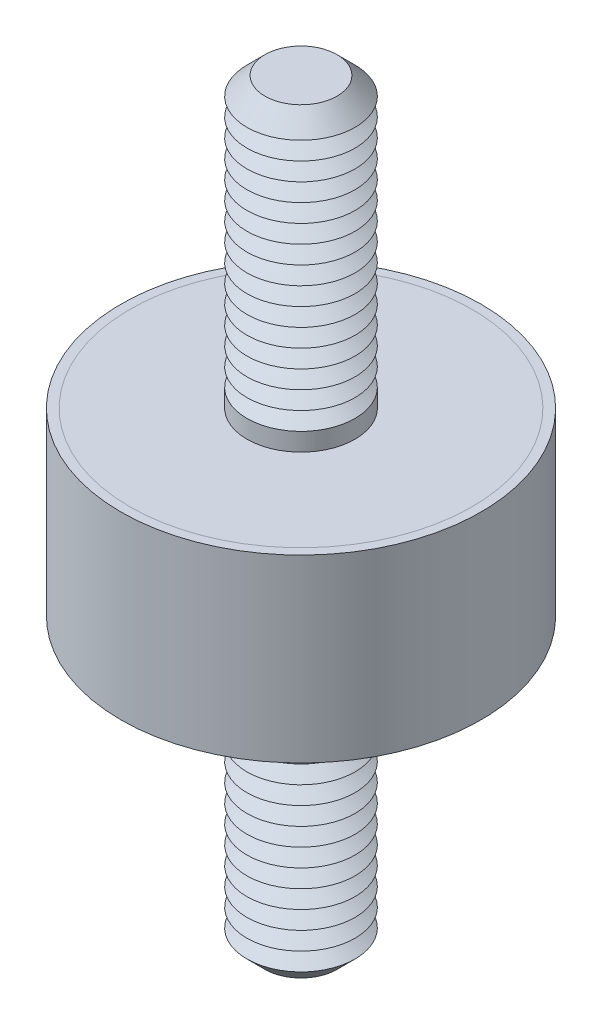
ISO-10303-21;
HEADER;
FILE_DESCRIPTION(('STEP AP214'),'2;1');
FILE_NAME('part.step','',(''),(''),'','','');
FILE_SCHEMA(('AUTOMOTIVE_DESIGN { 1 0 10303 214 1 1 1 1 }'));
ENDSEC;
DATA;
#1=APPLICATION_CONTEXT('core data for automotive mechanical design processes');
#2=APPLICATION_PROTOCOL_DEFINITION('international standard','automotive_design',2000,#1);
#3=PRODUCT_CONTEXT('',#1,'mechanical');
#4=PRODUCT('Part','Part','',(#3));
#5=PRODUCT_RELATED_PRODUCT_CATEGORY('part','',(#4));
#6=PRODUCT_DEFINITION_FORMATION('','',#4);
#7=PRODUCT_DEFINITION_CONTEXT('part definition',#1,'design');
#8=PRODUCT_DEFINITION('design','',#6,#7);
#9=PRODUCT_DEFINITION_SHAPE('','',#8);
#10=(LENGTH_UNIT() NAMED_UNIT(*) SI_UNIT(.MILLI.,.METRE.));
#11=(NAMED_UNIT(*) PLANE_ANGLE_UNIT() SI_UNIT($,.RADIAN.));
#12=(NAMED_UNIT(*) SI_UNIT($,.STERADIAN.) SOLID_ANGLE_UNIT());
#13=UNCERTAINTY_MEASURE_WITH_UNIT(LENGTH_MEASURE(1.E-05),#10,'distance_accuracy_value','');
#14=(GEOMETRIC_REPRESENTATION_CONTEXT(3) GLOBAL_UNCERTAINTY_ASSIGNED_CONTEXT((#13)) GLOBAL_UNIT_ASSIGNED_CONTEXT((#10,
#11,#12)) REPRESENTATION_CONTEXT('',''));
#15=CARTESIAN_POINT('',(0.,0.,0.));
#16=DIRECTION('',(0.,0.,1.));
#17=DIRECTION('',(1.,0.,0.));
#18=AXIS2_PLACEMENT_3D('',#15,#16,#17);
#19=CARTESIAN_POINT('',(0.,-21.,0.));
#20=DIRECTION('',(0.,1.,0.));
#21=DIRECTION('',(0.,0.,1.));
#22=AXIS2_PLACEMENT_3D('',#19,#20,#21);
#23=CYLINDRICAL_SURFACE('',#22,3.);
#24=CARTESIAN_POINT('',(0.,-5.,0.));
#25=DIRECTION('',(0.,-1.,0.));
#26=DIRECTION('',(0.,0.,-1.));
#27=AXIS2_PLACEMENT_3D('',#24,#25,#26);
#28=CIRCLE('',#27,3.);
#29=CARTESIAN_POINT('',(0.,-5.,-3.));
#30=VERTEX_POINT('',#29);
#31=EDGE_CURVE('P0_E21',#30,#30,#28,.T.);
#32=ORIENTED_EDGE('',*,*,#31,.T.);
#33=EDGE_LOOP('',(#32));
#34=FACE_BOUND('',#33,.T.);
#35=CARTESIAN_POINT('',(0.,-6.,0.));
#36=DIRECTION('',(0.,1.,0.));
#37=DIRECTION('',(0.,0.,1.));
#38=AXIS2_PLACEMENT_3D('',#35,#36,#37);
#39=CIRCLE('',#38,3.);
#40=CARTESIAN_POINT('',(0.,-6.,3.));
#41=VERTEX_POINT('',#40);
#42=EDGE_CURVE('P0_E33',#41,#41,#39,.T.);
#43=ORIENTED_EDGE('',*,*,#42,.T.);
#44=EDGE_LOOP('',(#43));
#45=FACE_BOUND('',#44,.T.);
#46=ADVANCED_FACE('P0_F14',(#34,#45),#23,.T.);
#47=CARTESIAN_POINT('',(0.,-5.,0.));
#48=DIRECTION('',(0.,1.,0.));
#49=DIRECTION('',(0.,0.,1.));
#50=AXIS2_PLACEMENT_3D('',#47,#48,#49);
#51=CYLINDRICAL_SURFACE('',#50,9.5);
#52=CARTESIAN_POINT('',(0.,-5.,0.));
#53=DIRECTION('',(0.,1.,0.));
#54=DIRECTION('',(0.,0.,1.));
#55=AXIS2_PLACEMENT_3D('',#52,#53,#54);
#56=CIRCLE('',#55,9.5);
#57=CARTESIAN_POINT('',(0.,-5.,9.5));
#58=VERTEX_POINT('',#57);
#59=EDGE_CURVE('P0_E25',#58,#58,#56,.T.);
#60=ORIENTED_EDGE('',*,*,#59,.T.);
#61=EDGE_LOOP('',(#60));
#62=FACE_BOUND('',#61,.T.);
#63=CARTESIAN_POINT('',(0.,-4.5,0.));
#64=DIRECTION('',(0.,1.,0.));
#65=DIRECTION('',(0.,0.,1.));
#66=AXIS2_PLACEMENT_3D('',#63,#64,#65);
#67=CIRCLE('',#66,9.5);
#68=CARTESIAN_POINT('',(0.,-4.5,9.5));
#69=VERTEX_POINT('',#68);
#70=EDGE_CURVE('P0_E30',#69,#69,#67,.T.);
#71=ORIENTED_EDGE('',*,*,#70,.F.);
#72=EDGE_LOOP('',(#71));
#73=FACE_BOUND('',#72,.T.);
#74=ADVANCED_FACE('P0_F145',(#62,#73),#51,.T.);
#75=CARTESIAN_POINT('',(0.,-5.,0.));
#76=DIRECTION('',(0.,1.,0.));
#77=DIRECTION('',(0.,0.,1.));
#78=AXIS2_PLACEMENT_3D('',#75,#76,#77);
#79=PLANE('',#78);
#80=ORIENTED_EDGE('',*,*,#31,.F.);
#81=EDGE_LOOP('',(#80));
#82=FACE_BOUND('',#81,.T.);
#83=ORIENTED_EDGE('',*,*,#59,.F.);
#84=EDGE_LOOP('',(#83));
#85=FACE_BOUND('',#84,.T.);
#86=ADVANCED_FACE('P0_F150',(#82,#85),#79,.F.);
#87=CARTESIAN_POINT('',(0.,-4.5,0.));
#88=DIRECTION('',(0.,1.,0.));
#89=DIRECTION('',(0.,0.,1.));
#90=AXIS2_PLACEMENT_3D('',#87,#88,#89);
#91=PLANE('',#90);
#92=ORIENTED_EDGE('',*,*,#70,.T.);
#93=EDGE_LOOP('',(#92));
#94=FACE_BOUND('',#93,.T.);
#95=ADVANCED_FACE('P0_F156',(#94),#91,.T.);
#96=CARTESIAN_POINT('',(0.,-6.,0.));
#97=DIRECTION('',(0.,1.,0.));
#98=DIRECTION('',(0.,0.,1.));
#99=AXIS2_PLACEMENT_3D('',#96,#97,#98);
#100=CONICAL_SURFACE('',#99,3.,1.0471975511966);
#101=CARTESIAN_POINT('',(0.,-6.5,0.));
#102=DIRECTION('',(0.,1.,0.));
#103=DIRECTION('',(0.,0.,1.));
#104=AXIS2_PLACEMENT_3D('',#101,#102,#103);
#105=CIRCLE('',#104,2.13397459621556);
#106=CARTESIAN_POINT('',(0.,-6.5,2.13397459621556));
#107=VERTEX_POINT('',#106);
#108=EDGE_CURVE('P0_E39',#107,#107,#105,.T.);
#109=ORIENTED_EDGE('',*,*,#108,.T.);
#110=EDGE_LOOP('',(#109));
#111=FACE_BOUND('',#110,.T.);
#112=ORIENTED_EDGE('',*,*,#42,.F.);
#113=EDGE_LOOP('',(#112));
#114=FACE_BOUND('',#113,.T.);
#115=ADVANCED_FACE('P0_F159',(#111,#114),#100,.T.);
#116=CARTESIAN_POINT('',(0.,-6.5,0.));
#117=DIRECTION('',(0.,-1.,0.));
#118=DIRECTION('',(0.,0.,-1.));
#119=AXIS2_PLACEMENT_3D('',#116,#117,#118);
#120=CONICAL_SURFACE('',#119,2.13397459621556,1.0471975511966);
#121=CARTESIAN_POINT('',(0.,-7.,0.));
#122=DIRECTION('',(0.,1.,0.));
#123=DIRECTION('',(0.,0.,1.));
#124=AXIS2_PLACEMENT_3D('',#121,#122,#123);
#125=CIRCLE('',#124,3.);
#126=CARTESIAN_POINT('',(0.,-7.,3.));
#127=VERTEX_POINT('',#126);
#128=EDGE_CURVE('P0_E43',#127,#127,#125,.T.);
#129=ORIENTED_EDGE('',*,*,#128,.T.);
#130=EDGE_LOOP('',(#129));
#131=FACE_BOUND('',#130,.T.);
#132=ORIENTED_EDGE('',*,*,#108,.F.);
#133=EDGE_LOOP('',(#132));
#134=FACE_BOUND('',#133,.T.);
#135=ADVANCED_FACE('P0_F163',(#131,#134),#120,.T.);
#136=CARTESIAN_POINT('',(0.,-7.,0.));
#137=DIRECTION('',(0.,1.,0.));
#138=DIRECTION('',(0.,0.,1.));
#139=AXIS2_PLACEMENT_3D('',#136,#137,#138);
#140=CONICAL_SURFACE('',#139,3.,1.0471975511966);
#141=CARTESIAN_POINT('',(0.,-7.5,0.));
#142=DIRECTION('',(0.,1.,0.));
#143=DIRECTION('',(0.,0.,1.));
#144=AXIS2_PLACEMENT_3D('',#141,#142,#143);
#145=CIRCLE('',#144,2.13397459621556);
#146=CARTESIAN_POINT('',(0.,-7.5,2.13397459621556));
#147=VERTEX_POINT('',#146);
#148=EDGE_CURVE('P0_E47',#147,#147,#145,.T.);
#149=ORIENTED_EDGE('',*,*,#148,.T.);
#150=EDGE_LOOP('',(#149));
#151=FACE_BOUND('',#150,.T.);
#152=ORIENTED_EDGE('',*,*,#128,.F.);
#153=EDGE_LOOP('',(#152));
#154=FACE_BOUND('',#153,.T.);
#155=ADVANCED_FACE('P0_F167',(#151,#154),#140,.T.);
#156=CARTESIAN_POINT('',(0.,-7.5,0.));
#157=DIRECTION('',(0.,-1.,0.));
#158=DIRECTION('',(0.,0.,-1.));
#159=AXIS2_PLACEMENT_3D('',#156,#157,#158);
#160=CONICAL_SURFACE('',#159,2.13397459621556,1.0471975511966);
#161=CARTESIAN_POINT('',(0.,-8.,0.));
#162=DIRECTION('',(0.,1.,0.));
#163=DIRECTION('',(0.,0.,1.));
#164=AXIS2_PLACEMENT_3D('',#161,#162,#163);
#165=CIRCLE('',#164,3.);
#166=CARTESIAN_POINT('',(0.,-8.,3.));
#167=VERTEX_POINT('',#166);
#168=EDGE_CURVE('P0_E52',#167,#167,#165,.T.);
#169=ORIENTED_EDGE('',*,*,#168,.T.);
#170=EDGE_LOOP('',(#169));
#171=FACE_BOUND('',#170,.T.);
#172=ORIENTED_EDGE('',*,*,#148,.F.);
#173=EDGE_LOOP('',(#172));
#174=FACE_BOUND('',#173,.T.);
#175=ADVANCED_FACE('P0_F174',(#171,#174),#160,.T.);
#176=CARTESIAN_POINT('',(0.,-8.,0.));
#177=DIRECTION('',(0.,1.,0.));
#178=DIRECTION('',(0.,0.,1.));
#179=AXIS2_PLACEMENT_3D('',#176,#177,#178);
#180=CONICAL_SURFACE('',#179,3.,1.0471975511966);
#181=CARTESIAN_POINT('',(0.,-8.5,0.));
#182=DIRECTION('',(0.,1.,0.));
#183=DIRECTION('',(0.,0.,1.));
#184=AXIS2_PLACEMENT_3D('',#181,#182,#183);
#185=CIRCLE('',#184,2.13397459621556);
#186=CARTESIAN_POINT('',(0.,-8.5,2.13397459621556));
#187=VERTEX_POINT('',#186);
#188=EDGE_CURVE('P0_E55',#187,#187,#185,.T.);
#189=ORIENTED_EDGE('',*,*,#188,.T.);
#190=EDGE_LOOP('',(#189));
#191=FACE_BOUND('',#190,.T.);
#192=ORIENTED_EDGE('',*,*,#168,.F.);
#193=EDGE_LOOP('',(#192));
#194=FACE_BOUND('',#193,.T.);
#195=ADVANCED_FACE('P0_F178',(#191,#194),#180,.T.);
#196=CARTESIAN_POINT('',(0.,-8.5,0.));
#197=DIRECTION('',(0.,-1.,0.));
#198=DIRECTION('',(0.,0.,-1.));
#199=AXIS2_PLACEMENT_3D('',#196,#197,#198);
#200=CONICAL_SURFACE('',#199,2.13397459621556,1.0471975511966);
#201=CARTESIAN_POINT('',(0.,-9.,0.));
#202=DIRECTION('',(0.,1.,0.));
#203=DIRECTION('',(0.,0.,1.));
#204=AXIS2_PLACEMENT_3D('',#201,#202,#203);
#205=CIRCLE('',#204,3.);
#206=CARTESIAN_POINT('',(0.,-9.,3.));
#207=VERTEX_POINT('',#206);
#208=EDGE_CURVE('P0_E58',#207,#207,#205,.T.);
#209=ORIENTED_EDGE('',*,*,#208,.T.);
#210=EDGE_LOOP('',(#209));
#211=FACE_BOUND('',#210,.T.);
#212=ORIENTED_EDGE('',*,*,#188,.F.);
#213=EDGE_LOOP('',(#212));
#214=FACE_BOUND('',#213,.T.);
#215=ADVANCED_FACE('P0_F182',(#211,#214),#200,.T.);
#216=CARTESIAN_POINT('',(0.,-9.,0.));
#217=DIRECTION('',(0.,1.,0.));
#218=DIRECTION('',(0.,0.,1.));
#219=AXIS2_PLACEMENT_3D('',#216,#217,#218);
#220=CONICAL_SURFACE('',#219,3.,1.0471975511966);
#221=CARTESIAN_POINT('',(0.,-9.5,0.));
#222=DIRECTION('',(0.,1.,0.));
#223=DIRECTION('',(0.,0.,1.));
#224=AXIS2_PLACEMENT_3D('',#221,#222,#223);
#225=CIRCLE('',#224,2.13397459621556);
#226=CARTESIAN_POINT('',(0.,-9.5,2.13397459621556));
#227=VERTEX_POINT('',#226);
#228=EDGE_CURVE('P0_E61',#227,#227,#225,.T.);
#229=ORIENTED_EDGE('',*,*,#228,.T.);
#230=EDGE_LOOP('',(#229));
#231=FACE_BOUND('',#230,.T.);
#232=ORIENTED_EDGE('',*,*,#208,.F.);
#233=EDGE_LOOP('',(#232));
#234=FACE_BOUND('',#233,.T.);
#235=ADVANCED_FACE('P0_F186',(#231,#234),#220,.T.);
#236=CARTESIAN_POINT('',(0.,-9.5,0.));
#237=DIRECTION('',(0.,-1.,0.));
#238=DIRECTION('',(0.,0.,-1.));
#239=AXIS2_PLACEMENT_3D('',#236,#237,#238);
#240=CONICAL_SURFACE('',#239,2.13397459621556,1.0471975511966);
#241=CARTESIAN_POINT('',(0.,-10.,0.));
#242=DIRECTION('',(0.,1.,0.));
#243=DIRECTION('',(0.,0.,1.));
#244=AXIS2_PLACEMENT_3D('',#241,#242,#243);
#245=CIRCLE('',#244,3.);
#246=CARTESIAN_POINT('',(0.,-10.,3.));
#247=VERTEX_POINT('',#246);
#248=EDGE_CURVE('P0_E64',#247,#247,#245,.T.);
#249=ORIENTED_EDGE('',*,*,#248,.T.);
#250=EDGE_LOOP('',(#249));
#251=FACE_BOUND('',#250,.T.);
#252=ORIENTED_EDGE('',*,*,#228,.F.);
#253=EDGE_LOOP('',(#252));
#254=FACE_BOUND('',#253,.T.);
#255=ADVANCED_FACE('P0_F190',(#251,#254),#240,.T.);
#256=CARTESIAN_POINT('',(0.,-10.,0.));
#257=DIRECTION('',(0.,1.,0.));
#258=DIRECTION('',(0.,0.,1.));
#259=AXIS2_PLACEMENT_3D('',#256,#257,#258);
#260=CONICAL_SURFACE('',#259,3.,1.0471975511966);
#261=CARTESIAN_POINT('',(0.,-10.5,0.));
#262=DIRECTION('',(0.,1.,0.));
#263=DIRECTION('',(0.,0.,1.));
#264=AXIS2_PLACEMENT_3D('',#261,#262,#263);
#265=CIRCLE('',#264,2.13397459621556);
#266=CARTESIAN_POINT('',(0.,-10.5,2.13397459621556));
#267=VERTEX_POINT('',#266);
#268=EDGE_CURVE('P0_E67',#267,#267,#265,.T.);
#269=ORIENTED_EDGE('',*,*,#268,.T.);
#270=EDGE_LOOP('',(#269));
#271=FACE_BOUND('',#270,.T.);
#272=ORIENTED_EDGE('',*,*,#248,.F.);
#273=EDGE_LOOP('',(#272));
#274=FACE_BOUND('',#273,.T.);
#275=ADVANCED_FACE('P0_F194',(#271,#274),#260,.T.);
#276=CARTESIAN_POINT('',(0.,-10.5,0.));
#277=DIRECTION('',(0.,-1.,0.));
#278=DIRECTION('',(0.,0.,-1.));
#279=AXIS2_PLACEMENT_3D('',#276,#277,#278);
#280=CONICAL_SURFACE('',#279,2.13397459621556,1.0471975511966);
#281=CARTESIAN_POINT('',(0.,-11.,0.));
#282=DIRECTION('',(0.,1.,0.));
#283=DIRECTION('',(0.,0.,1.));
#284=AXIS2_PLACEMENT_3D('',#281,#282,#283);
#285=CIRCLE('',#284,3.);
#286=CARTESIAN_POINT('',(0.,-11.,3.));
#287=VERTEX_POINT('',#286);
#288=EDGE_CURVE('P0_E70',#287,#287,#285,.T.);
#289=ORIENTED_EDGE('',*,*,#288,.T.);
#290=EDGE_LOOP('',(#289));
#291=FACE_BOUND('',#290,.T.);
#292=ORIENTED_EDGE('',*,*,#268,.F.);
#293=EDGE_LOOP('',(#292));
#294=FACE_BOUND('',#293,.T.);
#295=ADVANCED_FACE('P0_F198',(#291,#294),#280,.T.);
#296=CARTESIAN_POINT('',(0.,-11.,0.));
#297=DIRECTION('',(0.,1.,0.));
#298=DIRECTION('',(0.,0.,1.));
#299=AXIS2_PLACEMENT_3D('',#296,#297,#298);
#300=CONICAL_SURFACE('',#299,3.,1.0471975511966);
#301=CARTESIAN_POINT('',(0.,-11.5,0.));
#302=DIRECTION('',(0.,1.,0.));
#303=DIRECTION('',(0.,0.,1.));
#304=AXIS2_PLACEMENT_3D('',#301,#302,#303);
#305=CIRCLE('',#304,2.13397459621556);
#306=CARTESIAN_POINT('',(0.,-11.5,2.13397459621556));
#307=VERTEX_POINT('',#306);
#308=EDGE_CURVE('P0_E73',#307,#307,#305,.T.);
#309=ORIENTED_EDGE('',*,*,#308,.T.);
#310=EDGE_LOOP('',(#309));
#311=FACE_BOUND('',#310,.T.);
#312=ORIENTED_EDGE('',*,*,#288,.F.);
#313=EDGE_LOOP('',(#312));
#314=FACE_BOUND('',#313,.T.);
#315=ADVANCED_FACE('P0_F202',(#311,#314),#300,.T.);
#316=CARTESIAN_POINT('',(0.,-11.5,0.));
#317=DIRECTION('',(0.,-1.,0.));
#318=DIRECTION('',(0.,0.,-1.));
#319=AXIS2_PLACEMENT_3D('',#316,#317,#318);
#320=CONICAL_SURFACE('',#319,2.13397459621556,1.0471975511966);
#321=CARTESIAN_POINT('',(0.,-12.,0.));
#322=DIRECTION('',(0.,1.,0.));
#323=DIRECTION('',(0.,0.,1.));
#324=AXIS2_PLACEMENT_3D('',#321,#322,#323);
#325=CIRCLE('',#324,3.);
#326=CARTESIAN_POINT('',(0.,-12.,3.));
#327=VERTEX_POINT('',#326);
#328=EDGE_CURVE('P0_E76',#327,#327,#325,.T.);
#329=ORIENTED_EDGE('',*,*,#328,.T.);
#330=EDGE_LOOP('',(#329));
#331=FACE_BOUND('',#330,.T.);
#332=ORIENTED_EDGE('',*,*,#308,.F.);
#333=EDGE_LOOP('',(#332));
#334=FACE_BOUND('',#333,.T.);
#335=ADVANCED_FACE('P0_F206',(#331,#334),#320,.T.);
#336=CARTESIAN_POINT('',(0.,-12.,0.));
#337=DIRECTION('',(0.,1.,0.));
#338=DIRECTION('',(0.,0.,1.));
#339=AXIS2_PLACEMENT_3D('',#336,#337,#338);
#340=CONICAL_SURFACE('',#339,3.,1.0471975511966);
#341=CARTESIAN_POINT('',(0.,-12.5,0.));
#342=DIRECTION('',(0.,1.,0.));
#343=DIRECTION('',(0.,0.,1.));
#344=AXIS2_PLACEMENT_3D('',#341,#342,#343);
#345=CIRCLE('',#344,2.13397459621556);
#346=CARTESIAN_POINT('',(0.,-12.5,2.13397459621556));
#347=VERTEX_POINT('',#346);
#348=EDGE_CURVE('P0_E79',#347,#347,#345,.T.);
#349=ORIENTED_EDGE('',*,*,#348,.T.);
#350=EDGE_LOOP('',(#349));
#351=FACE_BOUND('',#350,.T.);
#352=ORIENTED_EDGE('',*,*,#328,.F.);
#353=EDGE_LOOP('',(#352));
#354=FACE_BOUND('',#353,.T.);
#355=ADVANCED_FACE('P0_F210',(#351,#354),#340,.T.);
#356=CARTESIAN_POINT('',(0.,-12.5,0.));
#357=DIRECTION('',(0.,-1.,0.));
#358=DIRECTION('',(0.,0.,-1.));
#359=AXIS2_PLACEMENT_3D('',#356,#357,#358);
#360=CONICAL_SURFACE('',#359,2.13397459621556,1.0471975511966);
#361=CARTESIAN_POINT('',(0.,-13.,0.));
#362=DIRECTION('',(0.,1.,0.));
#363=DIRECTION('',(0.,0.,1.));
#364=AXIS2_PLACEMENT_3D('',#361,#362,#363);
#365=CIRCLE('',#364,3.);
#366=CARTESIAN_POINT('',(0.,-13.,3.));
#367=VERTEX_POINT('',#366);
#368=EDGE_CURVE('P0_E82',#367,#367,#365,.T.);
#369=ORIENTED_EDGE('',*,*,#368,.T.);
#370=EDGE_LOOP('',(#369));
#371=FACE_BOUND('',#370,.T.);
#372=ORIENTED_EDGE('',*,*,#348,.F.);
#373=EDGE_LOOP('',(#372));
#374=FACE_BOUND('',#373,.T.);
#375=ADVANCED_FACE('P0_F214',(#371,#374),#360,.T.);
#376=CARTESIAN_POINT('',(0.,-13.,0.));
#377=DIRECTION('',(0.,1.,0.));
#378=DIRECTION('',(0.,0.,1.));
#379=AXIS2_PLACEMENT_3D('',#376,#377,#378);
#380=CONICAL_SURFACE('',#379,3.,1.0471975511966);
#381=CARTESIAN_POINT('',(0.,-13.5,0.));
#382=DIRECTION('',(0.,1.,0.));
#383=DIRECTION('',(0.,0.,1.));
#384=AXIS2_PLACEMENT_3D('',#381,#382,#383);
#385=CIRCLE('',#384,2.13397459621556);
#386=CARTESIAN_POINT('',(0.,-13.5,2.13397459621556));
#387=VERTEX_POINT('',#386);
#388=EDGE_CURVE('P0_E85',#387,#387,#385,.T.);
#389=ORIENTED_EDGE('',*,*,#388,.T.);
#390=EDGE_LOOP('',(#389));
#391=FACE_BOUND('',#390,.T.);
#392=ORIENTED_EDGE('',*,*,#368,.F.);
#393=EDGE_LOOP('',(#392));
#394=FACE_BOUND('',#393,.T.);
#395=ADVANCED_FACE('P0_F218',(#391,#394),#380,.T.);
#396=CARTESIAN_POINT('',(0.,-13.5,0.));
#397=DIRECTION('',(0.,-1.,0.));
#398=DIRECTION('',(0.,0.,-1.));
#399=AXIS2_PLACEMENT_3D('',#396,#397,#398);
#400=CONICAL_SURFACE('',#399,2.13397459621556,1.0471975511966);
#401=CARTESIAN_POINT('',(0.,-14.,0.));
#402=DIRECTION('',(0.,1.,0.));
#403=DIRECTION('',(0.,0.,1.));
#404=AXIS2_PLACEMENT_3D('',#401,#402,#403);
#405=CIRCLE('',#404,3.);
#406=CARTESIAN_POINT('',(0.,-14.,3.));
#407=VERTEX_POINT('',#406);
#408=EDGE_CURVE('P0_E88',#407,#407,#405,.T.);
#409=ORIENTED_EDGE('',*,*,#408,.T.);
#410=EDGE_LOOP('',(#409));
#411=FACE_BOUND('',#410,.T.);
#412=ORIENTED_EDGE('',*,*,#388,.F.);
#413=EDGE_LOOP('',(#412));
#414=FACE_BOUND('',#413,.T.);
#415=ADVANCED_FACE('P0_F222',(#411,#414),#400,.T.);
#416=CARTESIAN_POINT('',(0.,-14.,0.));
#417=DIRECTION('',(0.,1.,0.));
#418=DIRECTION('',(0.,0.,1.));
#419=AXIS2_PLACEMENT_3D('',#416,#417,#418);
#420=CONICAL_SURFACE('',#419,3.,1.0471975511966);
#421=CARTESIAN_POINT('',(0.,-14.5,0.));
#422=DIRECTION('',(0.,1.,0.));
#423=DIRECTION('',(0.,0.,1.));
#424=AXIS2_PLACEMENT_3D('',#421,#422,#423);
#425=CIRCLE('',#424,2.13397459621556);
#426=CARTESIAN_POINT('',(0.,-14.5,2.13397459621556));
#427=VERTEX_POINT('',#426);
#428=EDGE_CURVE('P0_E91',#427,#427,#425,.T.);
#429=ORIENTED_EDGE('',*,*,#428,.T.);
#430=EDGE_LOOP('',(#429));
#431=FACE_BOUND('',#430,.T.);
#432=ORIENTED_EDGE('',*,*,#408,.F.);
#433=EDGE_LOOP('',(#432));
#434=FACE_BOUND('',#433,.T.);
#435=ADVANCED_FACE('P0_F226',(#431,#434),#420,.T.);
#436=CARTESIAN_POINT('',(0.,-14.5,0.));
#437=DIRECTION('',(0.,-1.,0.));
#438=DIRECTION('',(0.,0.,-1.));
#439=AXIS2_PLACEMENT_3D('',#436,#437,#438);
#440=CONICAL_SURFACE('',#439,2.13397459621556,1.0471975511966);
#441=CARTESIAN_POINT('',(0.,-15.,0.));
#442=DIRECTION('',(0.,1.,0.));
#443=DIRECTION('',(0.,0.,1.));
#444=AXIS2_PLACEMENT_3D('',#441,#442,#443);
#445=CIRCLE('',#444,3.);
#446=CARTESIAN_POINT('',(0.,-15.,3.));
#447=VERTEX_POINT('',#446);
#448=EDGE_CURVE('P0_E94',#447,#447,#445,.T.);
#449=ORIENTED_EDGE('',*,*,#448,.T.);
#450=EDGE_LOOP('',(#449));
#451=FACE_BOUND('',#450,.T.);
#452=ORIENTED_EDGE('',*,*,#428,.F.);
#453=EDGE_LOOP('',(#452));
#454=FACE_BOUND('',#453,.T.);
#455=ADVANCED_FACE('P0_F230',(#451,#454),#440,.T.);
#456=CARTESIAN_POINT('',(0.,-15.,0.));
#457=DIRECTION('',(0.,1.,0.));
#458=DIRECTION('',(0.,0.,1.));
#459=AXIS2_PLACEMENT_3D('',#456,#457,#458);
#460=CONICAL_SURFACE('',#459,3.,1.0471975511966);
#461=CARTESIAN_POINT('',(0.,-15.5,0.));
#462=DIRECTION('',(0.,1.,0.));
#463=DIRECTION('',(0.,0.,1.));
#464=AXIS2_PLACEMENT_3D('',#461,#462,#463);
#465=CIRCLE('',#464,2.13397459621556);
#466=CARTESIAN_POINT('',(0.,-15.5,2.13397459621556));
#467=VERTEX_POINT('',#466);
#468=EDGE_CURVE('P0_E97',#467,#467,#465,.T.);
#469=ORIENTED_EDGE('',*,*,#468,.T.);
#470=EDGE_LOOP('',(#469));
#471=FACE_BOUND('',#470,.T.);
#472=ORIENTED_EDGE('',*,*,#448,.F.);
#473=EDGE_LOOP('',(#472));
#474=FACE_BOUND('',#473,.T.);
#475=ADVANCED_FACE('P0_F234',(#471,#474),#460,.T.);
#476=CARTESIAN_POINT('',(0.,-15.5,0.));
#477=DIRECTION('',(0.,-1.,0.));
#478=DIRECTION('',(0.,0.,-1.));
#479=AXIS2_PLACEMENT_3D('',#476,#477,#478);
#480=CONICAL_SURFACE('',#479,2.13397459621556,1.0471975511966);
#481=CARTESIAN_POINT('',(0.,-16.,0.));
#482=DIRECTION('',(0.,1.,0.));
#483=DIRECTION('',(0.,0.,1.));
#484=AXIS2_PLACEMENT_3D('',#481,#482,#483);
#485=CIRCLE('',#484,3.);
#486=CARTESIAN_POINT('',(0.,-16.,3.));
#487=VERTEX_POINT('',#486);
#488=EDGE_CURVE('P0_E100',#487,#487,#485,.T.);
#489=ORIENTED_EDGE('',*,*,#488,.T.);
#490=EDGE_LOOP('',(#489));
#491=FACE_BOUND('',#490,.T.);
#492=ORIENTED_EDGE('',*,*,#468,.F.);
#493=EDGE_LOOP('',(#492));
#494=FACE_BOUND('',#493,.T.);
#495=ADVANCED_FACE('P0_F238',(#491,#494),#480,.T.);
#496=CARTESIAN_POINT('',(0.,-16.,0.));
#497=DIRECTION('',(0.,1.,0.));
#498=DIRECTION('',(0.,0.,1.));
#499=AXIS2_PLACEMENT_3D('',#496,#497,#498);
#500=CONICAL_SURFACE('',#499,3.,1.0471975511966);
#501=CARTESIAN_POINT('',(0.,-16.5,0.));
#502=DIRECTION('',(0.,1.,0.));
#503=DIRECTION('',(0.,0.,1.));
#504=AXIS2_PLACEMENT_3D('',#501,#502,#503);
#505=CIRCLE('',#504,2.13397459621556);
#506=CARTESIAN_POINT('',(0.,-16.5,2.13397459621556));
#507=VERTEX_POINT('',#506);
#508=EDGE_CURVE('P0_E103',#507,#507,#505,.T.);
#509=ORIENTED_EDGE('',*,*,#508,.T.);
#510=EDGE_LOOP('',(#509));
#511=FACE_BOUND('',#510,.T.);
#512=ORIENTED_EDGE('',*,*,#488,.F.);
#513=EDGE_LOOP('',(#512));
#514=FACE_BOUND('',#513,.T.);
#515=ADVANCED_FACE('P0_F242',(#511,#514),#500,.T.);
#516=CARTESIAN_POINT('',(0.,-16.5,0.));
#517=DIRECTION('',(0.,-1.,0.));
#518=DIRECTION('',(0.,0.,-1.));
#519=AXIS2_PLACEMENT_3D('',#516,#517,#518);
#520=CONICAL_SURFACE('',#519,2.13397459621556,1.0471975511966);
#521=CARTESIAN_POINT('',(0.,-17.,0.));
#522=DIRECTION('',(0.,1.,0.));
#523=DIRECTION('',(0.,0.,1.));
#524=AXIS2_PLACEMENT_3D('',#521,#522,#523);
#525=CIRCLE('',#524,3.);
#526=CARTESIAN_POINT('',(0.,-17.,3.));
#527=VERTEX_POINT('',#526);
#528=EDGE_CURVE('P0_E106',#527,#527,#525,.T.);
#529=ORIENTED_EDGE('',*,*,#528,.T.);
#530=EDGE_LOOP('',(#529));
#531=FACE_BOUND('',#530,.T.);
#532=ORIENTED_EDGE('',*,*,#508,.F.);
#533=EDGE_LOOP('',(#532));
#534=FACE_BOUND('',#533,.T.);
#535=ADVANCED_FACE('P0_F246',(#531,#534),#520,.T.);
#536=CARTESIAN_POINT('',(0.,-17.,0.));
#537=DIRECTION('',(0.,1.,0.));
#538=DIRECTION('',(0.,0.,1.));
#539=AXIS2_PLACEMENT_3D('',#536,#537,#538);
#540=CONICAL_SURFACE('',#539,3.,1.0471975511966);
#541=CARTESIAN_POINT('',(0.,-17.5,0.));
#542=DIRECTION('',(0.,1.,0.));
#543=DIRECTION('',(0.,0.,1.));
#544=AXIS2_PLACEMENT_3D('',#541,#542,#543);
#545=CIRCLE('',#544,2.13397459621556);
#546=CARTESIAN_POINT('',(0.,-17.5,2.13397459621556));
#547=VERTEX_POINT('',#546);
#548=EDGE_CURVE('P0_E109',#547,#547,#545,.T.);
#549=ORIENTED_EDGE('',*,*,#548,.T.);
#550=EDGE_LOOP('',(#549));
#551=FACE_BOUND('',#550,.T.);
#552=ORIENTED_EDGE('',*,*,#528,.F.);
#553=EDGE_LOOP('',(#552));
#554=FACE_BOUND('',#553,.T.);
#555=ADVANCED_FACE('P0_F250',(#551,#554),#540,.T.);
#556=CARTESIAN_POINT('',(0.,-17.5,0.));
#557=DIRECTION('',(0.,-1.,0.));
#558=DIRECTION('',(0.,0.,-1.));
#559=AXIS2_PLACEMENT_3D('',#556,#557,#558);
#560=CONICAL_SURFACE('',#559,2.13397459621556,1.0471975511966);
#561=CARTESIAN_POINT('',(0.,-18.,0.));
#562=DIRECTION('',(0.,1.,0.));
#563=DIRECTION('',(0.,0.,1.));
#564=AXIS2_PLACEMENT_3D('',#561,#562,#563);
#565=CIRCLE('',#564,3.);
#566=CARTESIAN_POINT('',(0.,-18.,3.));
#567=VERTEX_POINT('',#566);
#568=EDGE_CURVE('P0_E112',#567,#567,#565,.T.);
#569=ORIENTED_EDGE('',*,*,#568,.T.);
#570=EDGE_LOOP('',(#569));
#571=FACE_BOUND('',#570,.T.);
#572=ORIENTED_EDGE('',*,*,#548,.F.);
#573=EDGE_LOOP('',(#572));
#574=FACE_BOUND('',#573,.T.);
#575=ADVANCED_FACE('P0_F254',(#571,#574),#560,.T.);
#576=CARTESIAN_POINT('',(0.,-18.,0.));
#577=DIRECTION('',(0.,1.,0.));
#578=DIRECTION('',(0.,0.,1.));
#579=AXIS2_PLACEMENT_3D('',#576,#577,#578);
#580=CONICAL_SURFACE('',#579,3.,1.0471975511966);
#581=CARTESIAN_POINT('',(0.,-18.5,0.));
#582=DIRECTION('',(0.,1.,0.));
#583=DIRECTION('',(0.,0.,1.));
#584=AXIS2_PLACEMENT_3D('',#581,#582,#583);
#585=CIRCLE('',#584,2.13397459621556);
#586=CARTESIAN_POINT('',(0.,-18.5,2.13397459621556));
#587=VERTEX_POINT('',#586);
#588=EDGE_CURVE('P0_E115',#587,#587,#585,.T.);
#589=ORIENTED_EDGE('',*,*,#588,.T.);
#590=EDGE_LOOP('',(#589));
#591=FACE_BOUND('',#590,.T.);
#592=ORIENTED_EDGE('',*,*,#568,.F.);
#593=EDGE_LOOP('',(#592));
#594=FACE_BOUND('',#593,.T.);
#595=ADVANCED_FACE('P0_F258',(#591,#594),#580,.T.);
#596=CARTESIAN_POINT('',(0.,-18.5,0.));
#597=DIRECTION('',(0.,-1.,0.));
#598=DIRECTION('',(0.,0.,-1.));
#599=AXIS2_PLACEMENT_3D('',#596,#597,#598);
#600=CONICAL_SURFACE('',#599,2.13397459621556,1.0471975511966);
#601=CARTESIAN_POINT('',(0.,-19.,0.));
#602=DIRECTION('',(0.,1.,0.));
#603=DIRECTION('',(0.,0.,1.));
#604=AXIS2_PLACEMENT_3D('',#601,#602,#603);
#605=CIRCLE('',#604,3.);
#606=CARTESIAN_POINT('',(0.,-19.,3.));
#607=VERTEX_POINT('',#606);
#608=EDGE_CURVE('P0_E118',#607,#607,#605,.T.);
#609=ORIENTED_EDGE('',*,*,#608,.T.);
#610=EDGE_LOOP('',(#609));
#611=FACE_BOUND('',#610,.T.);
#612=ORIENTED_EDGE('',*,*,#588,.F.);
#613=EDGE_LOOP('',(#612));
#614=FACE_BOUND('',#613,.T.);
#615=ADVANCED_FACE('P0_F142',(#611,#614),#600,.T.);
#616=CARTESIAN_POINT('',(0.,-19.,0.));
#617=DIRECTION('',(0.,1.,0.));
#618=DIRECTION('',(0.,0.,1.));
#619=AXIS2_PLACEMENT_3D('',#616,#617,#618);
#620=CONICAL_SURFACE('',#619,3.,1.0471975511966);
#621=CARTESIAN_POINT('',(0.,-19.5,0.));
#622=DIRECTION('',(0.,1.,0.));
#623=DIRECTION('',(0.,0.,1.));
#624=AXIS2_PLACEMENT_3D('',#621,#622,#623);
#625=CIRCLE('',#624,2.13397459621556);
#626=CARTESIAN_POINT('',(0.,-19.5,2.13397459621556));
#627=VERTEX_POINT('',#626);
#628=EDGE_CURVE('P0_E124',#627,#627,#625,.T.);
#629=ORIENTED_EDGE('',*,*,#628,.T.);
#630=EDGE_LOOP('',(#629));
#631=FACE_BOUND('',#630,.T.);
#632=ORIENTED_EDGE('',*,*,#608,.F.);
#633=EDGE_LOOP('',(#632));
#634=FACE_BOUND('',#633,.T.);
#635=ADVANCED_FACE('P0_F128',(#631,#634),#620,.T.);
#636=CARTESIAN_POINT('',(0.,-19.5,0.));
#637=DIRECTION('',(0.,-1.,0.));
#638=DIRECTION('',(0.,0.,-1.));
#639=AXIS2_PLACEMENT_3D('',#636,#637,#638);
#640=CONICAL_SURFACE('',#639,2.13397459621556,1.0471975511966);
#641=CARTESIAN_POINT('',(0.,-20.,0.));
#642=DIRECTION('',(0.,1.,0.));
#643=DIRECTION('',(0.,0.,1.));
#644=AXIS2_PLACEMENT_3D('',#641,#642,#643);
#645=CIRCLE('',#644,3.);
#646=CARTESIAN_POINT('',(0.,-20.,3.));
#647=VERTEX_POINT('',#646);
#648=EDGE_CURVE('P0_E121',#647,#647,#645,.T.);
#649=ORIENTED_EDGE('',*,*,#648,.T.);
#650=EDGE_LOOP('',(#649));
#651=FACE_BOUND('',#650,.T.);
#652=ORIENTED_EDGE('',*,*,#628,.F.);
#653=EDGE_LOOP('',(#652));
#654=FACE_BOUND('',#653,.T.);
#655=ADVANCED_FACE('P0_F131',(#651,#654),#640,.T.);
#656=CARTESIAN_POINT('',(0.,-21.,0.));
#657=DIRECTION('',(0.,-1.,0.));
#658=DIRECTION('',(0.,0.,-1.));
#659=AXIS2_PLACEMENT_3D('',#656,#657,#658);
#660=PLANE('',#659);
#661=CARTESIAN_POINT('',(0.,-21.,0.));
#662=DIRECTION('',(0.,-1.,0.));
#663=DIRECTION('',(0.,0.,-1.));
#664=AXIS2_PLACEMENT_3D('',#661,#662,#663);
#665=CIRCLE('',#664,2.);
#666=CARTESIAN_POINT('',(0.,-21.,-2.));
#667=VERTEX_POINT('',#666);
#668=EDGE_CURVE('P0_E10',#667,#667,#665,.T.);
#669=ORIENTED_EDGE('',*,*,#668,.T.);
#670=EDGE_LOOP('',(#669));
#671=FACE_BOUND('',#670,.T.);
#672=ADVANCED_FACE('P0_F133',(#671),#660,.T.);
#673=CARTESIAN_POINT('',(0.,-21.,0.));
#674=DIRECTION('',(0.,1.,0.));
#675=DIRECTION('',(0.,0.,1.));
#676=AXIS2_PLACEMENT_3D('',#673,#674,#675);
#677=CONICAL_SURFACE('',#676,2.,0.785398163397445);
#678=ORIENTED_EDGE('',*,*,#648,.F.);
#679=EDGE_LOOP('',(#678));
#680=FACE_BOUND('',#679,.T.);
#681=ORIENTED_EDGE('',*,*,#668,.F.);
#682=EDGE_LOOP('',(#681));
#683=FACE_BOUND('',#682,.T.);
#684=ADVANCED_FACE('P0_F16',(#680,#683),#677,.T.);
#685=CLOSED_SHELL('',(#46,#74,#86,#95,#115,#135,#155,#175,#195,#215,#235,#255,#275,#295,#315,
#335,#355,#375,#395,#415,#435,#455,#475,#495,#515,#535,#555,#575,#595,#615,#635,#655,#672,#684));
#686=MANIFOLD_SOLID_BREP('P0_B1',#685);
#687=CARTESIAN_POINT('',(0.,21.,0.));
#688=DIRECTION('',(0.,-1.,0.));
#689=DIRECTION('',(0.,0.,-1.));
#690=AXIS2_PLACEMENT_3D('',#687,#688,#689);
#691=CYLINDRICAL_SURFACE('',#690,3.);
#692=CARTESIAN_POINT('',(0.,6.,0.));
#693=DIRECTION('',(0.,1.,0.));
#694=DIRECTION('',(0.,0.,1.));
#695=AXIS2_PLACEMENT_3D('',#692,#693,#694);
#696=CIRCLE('',#695,3.);
#697=CARTESIAN_POINT('',(0.,6.,3.));
#698=VERTEX_POINT('',#697);
#699=EDGE_CURVE('P1_E33',#698,#698,#696,.T.);
#700=ORIENTED_EDGE('',*,*,#699,.F.);
#701=EDGE_LOOP('',(#700));
#702=FACE_BOUND('',#701,.T.);
#703=CARTESIAN_POINT('',(0.,5.,0.));
#704=DIRECTION('',(0.,1.,0.));
#705=DIRECTION('',(0.,0.,1.));
#706=AXIS2_PLACEMENT_3D('',#703,#704,#705);
#707=CIRCLE('',#706,3.);
#708=CARTESIAN_POINT('',(0.,5.,3.));
#709=VERTEX_POINT('',#708);
#710=EDGE_CURVE('P1_E21',#709,#709,#707,.T.);
#711=ORIENTED_EDGE('',*,*,#710,.T.);
#712=EDGE_LOOP('',(#711));
#713=FACE_BOUND('',#712,.T.);
#714=ADVANCED_FACE('P1_F14',(#702,#713),#691,.T.);
#715=CARTESIAN_POINT('',(0.,5.,0.));
#716=DIRECTION('',(0.,-1.,0.));
#717=DIRECTION('',(0.,0.,-1.));
#718=AXIS2_PLACEMENT_3D('',#715,#716,#717);
#719=CYLINDRICAL_SURFACE('',#718,9.5);
#720=CARTESIAN_POINT('',(0.,5.,0.));
#721=DIRECTION('',(0.,1.,0.));
#722=DIRECTION('',(0.,0.,1.));
#723=AXIS2_PLACEMENT_3D('',#720,#721,#722);
#724=CIRCLE('',#723,9.5);
#725=CARTESIAN_POINT('',(0.,5.,9.5));
#726=VERTEX_POINT('',#725);
#727=EDGE_CURVE('P1_E25',#726,#726,#724,.T.);
#728=ORIENTED_EDGE('',*,*,#727,.F.);
#729=EDGE_LOOP('',(#728));
#730=FACE_BOUND('',#729,.T.);
#731=CARTESIAN_POINT('',(0.,4.5,0.));
#732=DIRECTION('',(0.,1.,0.));
#733=DIRECTION('',(0.,0.,1.));
#734=AXIS2_PLACEMENT_3D('',#731,#732,#733);
#735=CIRCLE('',#734,9.5);
#736=CARTESIAN_POINT('',(0.,4.5,9.5));
#737=VERTEX_POINT('',#736);
#738=EDGE_CURVE('P1_E30',#737,#737,#735,.T.);
#739=ORIENTED_EDGE('',*,*,#738,.T.);
#740=EDGE_LOOP('',(#739));
#741=FACE_BOUND('',#740,.T.);
#742=ADVANCED_FACE('P1_F292',(#730,#741),#719,.T.);
#743=CARTESIAN_POINT('',(0.,5.,0.));
#744=DIRECTION('',(0.,1.,0.));
#745=DIRECTION('',(0.,0.,1.));
#746=AXIS2_PLACEMENT_3D('',#743,#744,#745);
#747=PLANE('',#746);
#748=ORIENTED_EDGE('',*,*,#710,.F.);
#749=EDGE_LOOP('',(#748));
#750=FACE_BOUND('',#749,.T.);
#751=ORIENTED_EDGE('',*,*,#727,.T.);
#752=EDGE_LOOP('',(#751));
#753=FACE_BOUND('',#752,.T.);
#754=ADVANCED_FACE('P1_F298',(#750,#753),#747,.T.);
#755=CARTESIAN_POINT('',(0.,4.5,0.));
#756=DIRECTION('',(0.,1.,0.));
#757=DIRECTION('',(0.,0.,1.));
#758=AXIS2_PLACEMENT_3D('',#755,#756,#757);
#759=PLANE('',#758);
#760=ORIENTED_EDGE('',*,*,#738,.F.);
#761=EDGE_LOOP('',(#760));
#762=FACE_BOUND('',#761,.T.);
#763=ADVANCED_FACE('P1_F288',(#762),#759,.F.);
#764=CARTESIAN_POINT('',(0.,6.,0.));
#765=DIRECTION('',(0.,-1.,0.));
#766=DIRECTION('',(0.,0.,-1.));
#767=AXIS2_PLACEMENT_3D('',#764,#765,#766);
#768=CONICAL_SURFACE('',#767,3.,1.0471975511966);
#769=CARTESIAN_POINT('',(0.,6.5,0.));
#770=DIRECTION('',(0.,1.,0.));
#771=DIRECTION('',(0.,0.,1.));
#772=AXIS2_PLACEMENT_3D('',#769,#770,#771);
#773=CIRCLE('',#772,2.13397459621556);
#774=CARTESIAN_POINT('',(0.,6.5,2.13397459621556));
#775=VERTEX_POINT('',#774);
#776=EDGE_CURVE('P1_E39',#775,#775,#773,.T.);
#777=ORIENTED_EDGE('',*,*,#776,.F.);
#778=EDGE_LOOP('',(#777));
#779=FACE_BOUND('',#778,.T.);
#780=ORIENTED_EDGE('',*,*,#699,.T.);
#781=EDGE_LOOP('',(#780));
#782=FACE_BOUND('',#781,.T.);
#783=ADVANCED_FACE('P1_F282',(#779,#782),#768,.T.);
#784=CARTESIAN_POINT('',(0.,6.5,0.));
#785=DIRECTION('',(0.,1.,0.));
#786=DIRECTION('',(0.,0.,1.));
#787=AXIS2_PLACEMENT_3D('',#784,#785,#786);
#788=CONICAL_SURFACE('',#787,2.13397459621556,1.0471975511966);
#789=CARTESIAN_POINT('',(0.,7.,0.));
#790=DIRECTION('',(0.,1.,0.));
#791=DIRECTION('',(0.,0.,1.));
#792=AXIS2_PLACEMENT_3D('',#789,#790,#791);
#793=CIRCLE('',#792,3.);
#794=CARTESIAN_POINT('',(0.,7.,3.));
#795=VERTEX_POINT('',#794);
#796=EDGE_CURVE('P1_E43',#795,#795,#793,.T.);
#797=ORIENTED_EDGE('',*,*,#796,.F.);
#798=EDGE_LOOP('',(#797));
#799=FACE_BOUND('',#798,.T.);
#800=ORIENTED_EDGE('',*,*,#776,.T.);
#801=EDGE_LOOP('',(#800));
#802=FACE_BOUND('',#801,.T.);
#803=ADVANCED_FACE('P1_F277',(#799,#802),#788,.T.);
#804=CARTESIAN_POINT('',(0.,7.,0.));
#805=DIRECTION('',(0.,-1.,0.));
#806=DIRECTION('',(0.,0.,-1.));
#807=AXIS2_PLACEMENT_3D('',#804,#805,#806);
#808=CONICAL_SURFACE('',#807,3.,1.0471975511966);
#809=CARTESIAN_POINT('',(0.,7.5,0.));
#810=DIRECTION('',(0.,1.,0.));
#811=DIRECTION('',(0.,0.,1.));
#812=AXIS2_PLACEMENT_3D('',#809,#810,#811);
#813=CIRCLE('',#812,2.13397459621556);
#814=CARTESIAN_POINT('',(0.,7.5,2.13397459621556));
#815=VERTEX_POINT('',#814);
#816=EDGE_CURVE('P1_E47',#815,#815,#813,.T.);
#817=ORIENTED_EDGE('',*,*,#816,.F.);
#818=EDGE_LOOP('',(#817));
#819=FACE_BOUND('',#818,.T.);
#820=ORIENTED_EDGE('',*,*,#796,.T.);
#821=EDGE_LOOP('',(#820));
#822=FACE_BOUND('',#821,.T.);
#823=ADVANCED_FACE('P1_F271',(#819,#822),#808,.T.);
#824=CARTESIAN_POINT('',(0.,7.5,0.));
#825=DIRECTION('',(0.,1.,0.));
#826=DIRECTION('',(0.,0.,1.));
#827=AXIS2_PLACEMENT_3D('',#824,#825,#826);
#828=CONICAL_SURFACE('',#827,2.13397459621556,1.0471975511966);
#829=CARTESIAN_POINT('',(0.,8.,0.));
#830=DIRECTION('',(0.,1.,0.));
#831=DIRECTION('',(0.,0.,1.));
#832=AXIS2_PLACEMENT_3D('',#829,#830,#831);
#833=CIRCLE('',#832,3.);
#834=CARTESIAN_POINT('',(0.,8.,3.));
#835=VERTEX_POINT('',#834);
#836=EDGE_CURVE('P1_E52',#835,#835,#833,.T.);
#837=ORIENTED_EDGE('',*,*,#836,.F.);
#838=EDGE_LOOP('',(#837));
#839=FACE_BOUND('',#838,.T.);
#840=ORIENTED_EDGE('',*,*,#816,.T.);
#841=EDGE_LOOP('',(#840));
#842=FACE_BOUND('',#841,.T.);
#843=ADVANCED_FACE('P1_F265',(#839,#842),#828,.T.);
#844=CARTESIAN_POINT('',(0.,8.,0.));
#845=DIRECTION('',(0.,-1.,0.));
#846=DIRECTION('',(0.,0.,-1.));
#847=AXIS2_PLACEMENT_3D('',#844,#845,#846);
#848=CONICAL_SURFACE('',#847,3.,1.0471975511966);
#849=CARTESIAN_POINT('',(0.,8.5,0.));
#850=DIRECTION('',(0.,1.,0.));
#851=DIRECTION('',(0.,0.,1.));
#852=AXIS2_PLACEMENT_3D('',#849,#850,#851);
#853=CIRCLE('',#852,2.13397459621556);
#854=CARTESIAN_POINT('',(0.,8.5,2.13397459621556));
#855=VERTEX_POINT('',#854);
#856=EDGE_CURVE('P1_E55',#855,#855,#853,.T.);
#857=ORIENTED_EDGE('',*,*,#856,.F.);
#858=EDGE_LOOP('',(#857));
#859=FACE_BOUND('',#858,.T.);
#860=ORIENTED_EDGE('',*,*,#836,.T.);
#861=EDGE_LOOP('',(#860));
#862=FACE_BOUND('',#861,.T.);
#863=ADVANCED_FACE('P1_F259',(#859,#862),#848,.T.);
#864=CARTESIAN_POINT('',(0.,8.5,0.));
#865=DIRECTION('',(0.,1.,0.));
#866=DIRECTION('',(0.,0.,1.));
#867=AXIS2_PLACEMENT_3D('',#864,#865,#866);
#868=CONICAL_SURFACE('',#867,2.13397459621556,1.0471975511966);
#869=CARTESIAN_POINT('',(0.,9.,0.));
#870=DIRECTION('',(0.,1.,0.));
#871=DIRECTION('',(0.,0.,1.));
#872=AXIS2_PLACEMENT_3D('',#869,#870,#871);
#873=CIRCLE('',#872,3.);
#874=CARTESIAN_POINT('',(0.,9.,3.));
#875=VERTEX_POINT('',#874);
#876=EDGE_CURVE('P1_E58',#875,#875,#873,.T.);
#877=ORIENTED_EDGE('',*,*,#876,.F.);
#878=EDGE_LOOP('',(#877));
#879=FACE_BOUND('',#878,.T.);
#880=ORIENTED_EDGE('',*,*,#856,.T.);
#881=EDGE_LOOP('',(#880));
#882=FACE_BOUND('',#881,.T.);
#883=ADVANCED_FACE('P1_F253',(#879,#882),#868,.T.);
#884=CARTESIAN_POINT('',(0.,9.,0.));
#885=DIRECTION('',(0.,-1.,0.));
#886=DIRECTION('',(0.,0.,-1.));
#887=AXIS2_PLACEMENT_3D('',#884,#885,#886);
#888=CONICAL_SURFACE('',#887,3.,1.0471975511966);
#889=CARTESIAN_POINT('',(0.,9.5,0.));
#890=DIRECTION('',(0.,1.,0.));
#891=DIRECTION('',(0.,0.,1.));
#892=AXIS2_PLACEMENT_3D('',#889,#890,#891);
#893=CIRCLE('',#892,2.13397459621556);
#894=CARTESIAN_POINT('',(0.,9.5,2.13397459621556));
#895=VERTEX_POINT('',#894);
#896=EDGE_CURVE('P1_E61',#895,#895,#893,.T.);
#897=ORIENTED_EDGE('',*,*,#896,.F.);
#898=EDGE_LOOP('',(#897));
#899=FACE_BOUND('',#898,.T.);
#900=ORIENTED_EDGE('',*,*,#876,.T.);
#901=EDGE_LOOP('',(#900));
#902=FACE_BOUND('',#901,.T.);
#903=ADVANCED_FACE('P1_F247',(#899,#902),#888,.T.);
#904=CARTESIAN_POINT('',(0.,9.5,0.));
#905=DIRECTION('',(0.,1.,0.));
#906=DIRECTION('',(0.,0.,1.));
#907=AXIS2_PLACEMENT_3D('',#904,#905,#906);
#908=CONICAL_SURFACE('',#907,2.13397459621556,1.0471975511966);
#909=CARTESIAN_POINT('',(0.,10.,0.));
#910=DIRECTION('',(0.,1.,0.));
#911=DIRECTION('',(0.,0.,1.));
#912=AXIS2_PLACEMENT_3D('',#909,#910,#911);
#913=CIRCLE('',#912,3.);
#914=CARTESIAN_POINT('',(0.,10.,3.));
#915=VERTEX_POINT('',#914);
#916=EDGE_CURVE('P1_E64',#915,#915,#913,.T.);
#917=ORIENTED_EDGE('',*,*,#916,.F.);
#918=EDGE_LOOP('',(#917));
#919=FACE_BOUND('',#918,.T.);
#920=ORIENTED_EDGE('',*,*,#896,.T.);
#921=EDGE_LOOP('',(#920));
#922=FACE_BOUND('',#921,.T.);
#923=ADVANCED_FACE('P1_F241',(#919,#922),#908,.T.);
#924=CARTESIAN_POINT('',(0.,10.,0.));
#925=DIRECTION('',(0.,-1.,0.));
#926=DIRECTION('',(0.,0.,-1.));
#927=AXIS2_PLACEMENT_3D('',#924,#925,#926);
#928=CONICAL_SURFACE('',#927,3.,1.0471975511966);
#929=CARTESIAN_POINT('',(0.,10.5,0.));
#930=DIRECTION('',(0.,1.,0.));
#931=DIRECTION('',(0.,0.,1.));
#932=AXIS2_PLACEMENT_3D('',#929,#930,#931);
#933=CIRCLE('',#932,2.13397459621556);
#934=CARTESIAN_POINT('',(0.,10.5,2.13397459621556));
#935=VERTEX_POINT('',#934);
#936=EDGE_CURVE('P1_E67',#935,#935,#933,.T.);
#937=ORIENTED_EDGE('',*,*,#936,.F.);
#938=EDGE_LOOP('',(#937));
#939=FACE_BOUND('',#938,.T.);
#940=ORIENTED_EDGE('',*,*,#916,.T.);
#941=EDGE_LOOP('',(#940));
#942=FACE_BOUND('',#941,.T.);
#943=ADVANCED_FACE('P1_F235',(#939,#942),#928,.T.);
#944=CARTESIAN_POINT('',(0.,10.5,0.));
#945=DIRECTION('',(0.,1.,0.));
#946=DIRECTION('',(0.,0.,1.));
#947=AXIS2_PLACEMENT_3D('',#944,#945,#946);
#948=CONICAL_SURFACE('',#947,2.13397459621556,1.0471975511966);
#949=CARTESIAN_POINT('',(0.,11.,0.));
#950=DIRECTION('',(0.,1.,0.));
#951=DIRECTION('',(0.,0.,1.));
#952=AXIS2_PLACEMENT_3D('',#949,#950,#951);
#953=CIRCLE('',#952,3.);
#954=CARTESIAN_POINT('',(0.,11.,3.));
#955=VERTEX_POINT('',#954);
#956=EDGE_CURVE('P1_E70',#955,#955,#953,.T.);
#957=ORIENTED_EDGE('',*,*,#956,.F.);
#958=EDGE_LOOP('',(#957));
#959=FACE_BOUND('',#958,.T.);
#960=ORIENTED_EDGE('',*,*,#936,.T.);
#961=EDGE_LOOP('',(#960));
#962=FACE_BOUND('',#961,.T.);
#963=ADVANCED_FACE('P1_F229',(#959,#962),#948,.T.);
#964=CARTESIAN_POINT('',(0.,11.,0.));
#965=DIRECTION('',(0.,-1.,0.));
#966=DIRECTION('',(0.,0.,-1.));
#967=AXIS2_PLACEMENT_3D('',#964,#965,#966);
#968=CONICAL_SURFACE('',#967,3.,1.0471975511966);
#969=CARTESIAN_POINT('',(0.,11.5,0.));
#970=DIRECTION('',(0.,1.,0.));
#971=DIRECTION('',(0.,0.,1.));
#972=AXIS2_PLACEMENT_3D('',#969,#970,#971);
#973=CIRCLE('',#972,2.13397459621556);
#974=CARTESIAN_POINT('',(0.,11.5,2.13397459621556));
#975=VERTEX_POINT('',#974);
#976=EDGE_CURVE('P1_E73',#975,#975,#973,.T.);
#977=ORIENTED_EDGE('',*,*,#976,.F.);
#978=EDGE_LOOP('',(#977));
#979=FACE_BOUND('',#978,.T.);
#980=ORIENTED_EDGE('',*,*,#956,.T.);
#981=EDGE_LOOP('',(#980));
#982=FACE_BOUND('',#981,.T.);
#983=ADVANCED_FACE('P1_F223',(#979,#982),#968,.T.);
#984=CARTESIAN_POINT('',(0.,11.5,0.));
#985=DIRECTION('',(0.,1.,0.));
#986=DIRECTION('',(0.,0.,1.));
#987=AXIS2_PLACEMENT_3D('',#984,#985,#986);
#988=CONICAL_SURFACE('',#987,2.13397459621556,1.0471975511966);
#989=CARTESIAN_POINT('',(0.,12.,0.));
#990=DIRECTION('',(0.,1.,0.));
#991=DIRECTION('',(0.,0.,1.));
#992=AXIS2_PLACEMENT_3D('',#989,#990,#991);
#993=CIRCLE('',#992,3.);
#994=CARTESIAN_POINT('',(0.,12.,3.));
#995=VERTEX_POINT('',#994);
#996=EDGE_CURVE('P1_E76',#995,#995,#993,.T.);
#997=ORIENTED_EDGE('',*,*,#996,.F.);
#998=EDGE_LOOP('',(#997));
#999=FACE_BOUND('',#998,.T.);
#1000=ORIENTED_EDGE('',*,*,#976,.T.);
#1001=EDGE_LOOP('',(#1000));
#1002=FACE_BOUND('',#1001,.T.);
#1003=ADVANCED_FACE('P1_F217',(#999,#1002),#988,.T.);
#1004=CARTESIAN_POINT('',(0.,12.,0.));
#1005=DIRECTION('',(0.,-1.,0.));
#1006=DIRECTION('',(0.,0.,-1.));
#1007=AXIS2_PLACEMENT_3D('',#1004,#1005,#1006);
#1008=CONICAL_SURFACE('',#1007,3.,1.0471975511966);
#1009=CARTESIAN_POINT('',(0.,12.5,0.));
#1010=DIRECTION('',(0.,1.,0.));
#1011=DIRECTION('',(0.,0.,1.));
#1012=AXIS2_PLACEMENT_3D('',#1009,#1010,#1011);
#1013=CIRCLE('',#1012,2.13397459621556);
#1014=CARTESIAN_POINT('',(0.,12.5,2.13397459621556));
#1015=VERTEX_POINT('',#1014);
#1016=EDGE_CURVE('P1_E79',#1015,#1015,#1013,.T.);
#1017=ORIENTED_EDGE('',*,*,#1016,.F.);
#1018=EDGE_LOOP('',(#1017));
#1019=FACE_BOUND('',#1018,.T.);
#1020=ORIENTED_EDGE('',*,*,#996,.T.);
#1021=EDGE_LOOP('',(#1020));
#1022=FACE_BOUND('',#1021,.T.);
#1023=ADVANCED_FACE('P1_F211',(#1019,#1022),#1008,.T.);
#1024=CARTESIAN_POINT('',(0.,12.5,0.));
#1025=DIRECTION('',(0.,1.,0.));
#1026=DIRECTION('',(0.,0.,1.));
#1027=AXIS2_PLACEMENT_3D('',#1024,#1025,#1026);
#1028=CONICAL_SURFACE('',#1027,2.13397459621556,1.0471975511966);
#1029=CARTESIAN_POINT('',(0.,13.,0.));
#1030=DIRECTION('',(0.,1.,0.));
#1031=DIRECTION('',(0.,0.,1.));
#1032=AXIS2_PLACEMENT_3D('',#1029,#1030,#1031);
#1033=CIRCLE('',#1032,3.);
#1034=CARTESIAN_POINT('',(0.,13.,3.));
#1035=VERTEX_POINT('',#1034);
#1036=EDGE_CURVE('P1_E82',#1035,#1035,#1033,.T.);
#1037=ORIENTED_EDGE('',*,*,#1036,.F.);
#1038=EDGE_LOOP('',(#1037));
#1039=FACE_BOUND('',#1038,.T.);
#1040=ORIENTED_EDGE('',*,*,#1016,.T.);
#1041=EDGE_LOOP('',(#1040));
#1042=FACE_BOUND('',#1041,.T.);
#1043=ADVANCED_FACE('P1_F205',(#1039,#1042),#1028,.T.);
#1044=CARTESIAN_POINT('',(0.,13.,0.));
#1045=DIRECTION('',(0.,-1.,0.));
#1046=DIRECTION('',(0.,0.,-1.));
#1047=AXIS2_PLACEMENT_3D('',#1044,#1045,#1046);
#1048=CONICAL_SURFACE('',#1047,3.,1.0471975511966);
#1049=CARTESIAN_POINT('',(0.,13.5,0.));
#1050=DIRECTION('',(0.,1.,0.));
#1051=DIRECTION('',(0.,0.,1.));
#1052=AXIS2_PLACEMENT_3D('',#1049,#1050,#1051);
#1053=CIRCLE('',#1052,2.13397459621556);
#1054=CARTESIAN_POINT('',(0.,13.5,2.13397459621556));
#1055=VERTEX_POINT('',#1054);
#1056=EDGE_CURVE('P1_E85',#1055,#1055,#1053,.T.);
#1057=ORIENTED_EDGE('',*,*,#1056,.F.);
#1058=EDGE_LOOP('',(#1057));
#1059=FACE_BOUND('',#1058,.T.);
#1060=ORIENTED_EDGE('',*,*,#1036,.T.);
#1061=EDGE_LOOP('',(#1060));
#1062=FACE_BOUND('',#1061,.T.);
#1063=ADVANCED_FACE('P1_F199',(#1059,#1062),#1048,.T.);
#1064=CARTESIAN_POINT('',(0.,13.5,0.));
#1065=DIRECTION('',(0.,1.,0.));
#1066=DIRECTION('',(0.,0.,1.));
#1067=AXIS2_PLACEMENT_3D('',#1064,#1065,#1066);
#1068=CONICAL_SURFACE('',#1067,2.13397459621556,1.0471975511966);
#1069=CARTESIAN_POINT('',(0.,14.,0.));
#1070=DIRECTION('',(0.,1.,0.));
#1071=DIRECTION('',(0.,0.,1.));
#1072=AXIS2_PLACEMENT_3D('',#1069,#1070,#1071);
#1073=CIRCLE('',#1072,3.);
#1074=CARTESIAN_POINT('',(0.,14.,3.));
#1075=VERTEX_POINT('',#1074);
#1076=EDGE_CURVE('P1_E88',#1075,#1075,#1073,.T.);
#1077=ORIENTED_EDGE('',*,*,#1076,.F.);
#1078=EDGE_LOOP('',(#1077));
#1079=FACE_BOUND('',#1078,.T.);
#1080=ORIENTED_EDGE('',*,*,#1056,.T.);
#1081=EDGE_LOOP('',(#1080));
#1082=FACE_BOUND('',#1081,.T.);
#1083=ADVANCED_FACE('P1_F193',(#1079,#1082),#1068,.T.);
#1084=CARTESIAN_POINT('',(0.,14.,0.));
#1085=DIRECTION('',(0.,-1.,0.));
#1086=DIRECTION('',(0.,0.,-1.));
#1087=AXIS2_PLACEMENT_3D('',#1084,#1085,#1086);
#1088=CONICAL_SURFACE('',#1087,3.,1.0471975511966);
#1089=CARTESIAN_POINT('',(0.,14.5,0.));
#1090=DIRECTION('',(0.,1.,0.));
#1091=DIRECTION('',(0.,0.,1.));
#1092=AXIS2_PLACEMENT_3D('',#1089,#1090,#1091);
#1093=CIRCLE('',#1092,2.13397459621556);
#1094=CARTESIAN_POINT('',(0.,14.5,2.13397459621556));
#1095=VERTEX_POINT('',#1094);
#1096=EDGE_CURVE('P1_E91',#1095,#1095,#1093,.T.);
#1097=ORIENTED_EDGE('',*,*,#1096,.F.);
#1098=EDGE_LOOP('',(#1097));
#1099=FACE_BOUND('',#1098,.T.);
#1100=ORIENTED_EDGE('',*,*,#1076,.T.);
#1101=EDGE_LOOP('',(#1100));
#1102=FACE_BOUND('',#1101,.T.);
#1103=ADVANCED_FACE('P1_F187',(#1099,#1102),#1088,.T.);
#1104=CARTESIAN_POINT('',(0.,14.5,0.));
#1105=DIRECTION('',(0.,1.,0.));
#1106=DIRECTION('',(0.,0.,1.));
#1107=AXIS2_PLACEMENT_3D('',#1104,#1105,#1106);
#1108=CONICAL_SURFACE('',#1107,2.13397459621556,1.0471975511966);
#1109=CARTESIAN_POINT('',(0.,15.,0.));
#1110=DIRECTION('',(0.,1.,0.));
#1111=DIRECTION('',(0.,0.,1.));
#1112=AXIS2_PLACEMENT_3D('',#1109,#1110,#1111);
#1113=CIRCLE('',#1112,3.);
#1114=CARTESIAN_POINT('',(0.,15.,3.));
#1115=VERTEX_POINT('',#1114);
#1116=EDGE_CURVE('P1_E94',#1115,#1115,#1113,.T.);
#1117=ORIENTED_EDGE('',*,*,#1116,.F.);
#1118=EDGE_LOOP('',(#1117));
#1119=FACE_BOUND('',#1118,.T.);
#1120=ORIENTED_EDGE('',*,*,#1096,.T.);
#1121=EDGE_LOOP('',(#1120));
#1122=FACE_BOUND('',#1121,.T.);
#1123=ADVANCED_FACE('P1_F181',(#1119,#1122),#1108,.T.);
#1124=CARTESIAN_POINT('',(0.,15.,0.));
#1125=DIRECTION('',(0.,-1.,0.));
#1126=DIRECTION('',(0.,0.,-1.));
#1127=AXIS2_PLACEMENT_3D('',#1124,#1125,#1126);
#1128=CONICAL_SURFACE('',#1127,3.,1.0471975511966);
#1129=CARTESIAN_POINT('',(0.,15.5,0.));
#1130=DIRECTION('',(0.,1.,0.));
#1131=DIRECTION('',(0.,0.,1.));
#1132=AXIS2_PLACEMENT_3D('',#1129,#1130,#1131);
#1133=CIRCLE('',#1132,2.13397459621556);
#1134=CARTESIAN_POINT('',(0.,15.5,2.13397459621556));
#1135=VERTEX_POINT('',#1134);
#1136=EDGE_CURVE('P1_E97',#1135,#1135,#1133,.T.);
#1137=ORIENTED_EDGE('',*,*,#1136,.F.);
#1138=EDGE_LOOP('',(#1137));
#1139=FACE_BOUND('',#1138,.T.);
#1140=ORIENTED_EDGE('',*,*,#1116,.T.);
#1141=EDGE_LOOP('',(#1140));
#1142=FACE_BOUND('',#1141,.T.);
#1143=ADVANCED_FACE('P1_F175',(#1139,#1142),#1128,.T.);
#1144=CARTESIAN_POINT('',(0.,15.5,0.));
#1145=DIRECTION('',(0.,1.,0.));
#1146=DIRECTION('',(0.,0.,1.));
#1147=AXIS2_PLACEMENT_3D('',#1144,#1145,#1146);
#1148=CONICAL_SURFACE('',#1147,2.13397459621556,1.0471975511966);
#1149=CARTESIAN_POINT('',(0.,16.,0.));
#1150=DIRECTION('',(0.,1.,0.));
#1151=DIRECTION('',(0.,0.,1.));
#1152=AXIS2_PLACEMENT_3D('',#1149,#1150,#1151);
#1153=CIRCLE('',#1152,3.);
#1154=CARTESIAN_POINT('',(0.,16.,3.));
#1155=VERTEX_POINT('',#1154);
#1156=EDGE_CURVE('P1_E100',#1155,#1155,#1153,.T.);
#1157=ORIENTED_EDGE('',*,*,#1156,.F.);
#1158=EDGE_LOOP('',(#1157));
#1159=FACE_BOUND('',#1158,.T.);
#1160=ORIENTED_EDGE('',*,*,#1136,.T.);
#1161=EDGE_LOOP('',(#1160));
#1162=FACE_BOUND('',#1161,.T.);
#1163=ADVANCED_FACE('P1_F169',(#1159,#1162),#1148,.T.);
#1164=CARTESIAN_POINT('',(0.,16.,0.));
#1165=DIRECTION('',(0.,-1.,0.));
#1166=DIRECTION('',(0.,0.,-1.));
#1167=AXIS2_PLACEMENT_3D('',#1164,#1165,#1166);
#1168=CONICAL_SURFACE('',#1167,3.,1.0471975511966);
#1169=CARTESIAN_POINT('',(0.,16.5,0.));
#1170=DIRECTION('',(0.,1.,0.));
#1171=DIRECTION('',(0.,0.,1.));
#1172=AXIS2_PLACEMENT_3D('',#1169,#1170,#1171);
#1173=CIRCLE('',#1172,2.13397459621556);
#1174=CARTESIAN_POINT('',(0.,16.5,2.13397459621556));
#1175=VERTEX_POINT('',#1174);
#1176=EDGE_CURVE('P1_E103',#1175,#1175,#1173,.T.);
#1177=ORIENTED_EDGE('',*,*,#1176,.F.);
#1178=EDGE_LOOP('',(#1177));
#1179=FACE_BOUND('',#1178,.T.);
#1180=ORIENTED_EDGE('',*,*,#1156,.T.);
#1181=EDGE_LOOP('',(#1180));
#1182=FACE_BOUND('',#1181,.T.);
#1183=ADVANCED_FACE('P1_F163',(#1179,#1182),#1168,.T.);
#1184=CARTESIAN_POINT('',(0.,16.5,0.));
#1185=DIRECTION('',(0.,1.,0.));
#1186=DIRECTION('',(0.,0.,1.));
#1187=AXIS2_PLACEMENT_3D('',#1184,#1185,#1186);
#1188=CONICAL_SURFACE('',#1187,2.13397459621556,1.0471975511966);
#1189=CARTESIAN_POINT('',(0.,17.,0.));
#1190=DIRECTION('',(0.,1.,0.));
#1191=DIRECTION('',(0.,0.,1.));
#1192=AXIS2_PLACEMENT_3D('',#1189,#1190,#1191);
#1193=CIRCLE('',#1192,3.);
#1194=CARTESIAN_POINT('',(0.,17.,3.));
#1195=VERTEX_POINT('',#1194);
#1196=EDGE_CURVE('P1_E106',#1195,#1195,#1193,.T.);
#1197=ORIENTED_EDGE('',*,*,#1196,.F.);
#1198=EDGE_LOOP('',(#1197));
#1199=FACE_BOUND('',#1198,.T.);
#1200=ORIENTED_EDGE('',*,*,#1176,.T.);
#1201=EDGE_LOOP('',(#1200));
#1202=FACE_BOUND('',#1201,.T.);
#1203=ADVANCED_FACE('P1_F157',(#1199,#1202),#1188,.T.);
#1204=CARTESIAN_POINT('',(0.,17.,0.));
#1205=DIRECTION('',(0.,-1.,0.));
#1206=DIRECTION('',(0.,0.,-1.));
#1207=AXIS2_PLACEMENT_3D('',#1204,#1205,#1206);
#1208=CONICAL_SURFACE('',#1207,3.,1.0471975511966);
#1209=CARTESIAN_POINT('',(0.,17.5,0.));
#1210=DIRECTION('',(0.,1.,0.));
#1211=DIRECTION('',(0.,0.,1.));
#1212=AXIS2_PLACEMENT_3D('',#1209,#1210,#1211);
#1213=CIRCLE('',#1212,2.13397459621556);
#1214=CARTESIAN_POINT('',(0.,17.5,2.13397459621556));
#1215=VERTEX_POINT('',#1214);
#1216=EDGE_CURVE('P1_E109',#1215,#1215,#1213,.T.);
#1217=ORIENTED_EDGE('',*,*,#1216,.F.);
#1218=EDGE_LOOP('',(#1217));
#1219=FACE_BOUND('',#1218,.T.);
#1220=ORIENTED_EDGE('',*,*,#1196,.T.);
#1221=EDGE_LOOP('',(#1220));
#1222=FACE_BOUND('',#1221,.T.);
#1223=ADVANCED_FACE('P1_F151',(#1219,#1222),#1208,.T.);
#1224=CARTESIAN_POINT('',(0.,17.5,0.));
#1225=DIRECTION('',(0.,1.,0.));
#1226=DIRECTION('',(0.,0.,1.));
#1227=AXIS2_PLACEMENT_3D('',#1224,#1225,#1226);
#1228=CONICAL_SURFACE('',#1227,2.13397459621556,1.0471975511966);
#1229=CARTESIAN_POINT('',(0.,18.,0.));
#1230=DIRECTION('',(0.,1.,0.));
#1231=DIRECTION('',(0.,0.,1.));
#1232=AXIS2_PLACEMENT_3D('',#1229,#1230,#1231);
#1233=CIRCLE('',#1232,3.);
#1234=CARTESIAN_POINT('',(0.,18.,3.));
#1235=VERTEX_POINT('',#1234);
#1236=EDGE_CURVE('P1_E112',#1235,#1235,#1233,.T.);
#1237=ORIENTED_EDGE('',*,*,#1236,.F.);
#1238=EDGE_LOOP('',(#1237));
#1239=FACE_BOUND('',#1238,.T.);
#1240=ORIENTED_EDGE('',*,*,#1216,.T.);
#1241=EDGE_LOOP('',(#1240));
#1242=FACE_BOUND('',#1241,.T.);
#1243=ADVANCED_FACE('P1_F145',(#1239,#1242),#1228,.T.);
#1244=CARTESIAN_POINT('',(0.,18.,0.));
#1245=DIRECTION('',(0.,-1.,0.));
#1246=DIRECTION('',(0.,0.,-1.));
#1247=AXIS2_PLACEMENT_3D('',#1244,#1245,#1246);
#1248=CONICAL_SURFACE('',#1247,3.,1.0471975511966);
#1249=CARTESIAN_POINT('',(0.,18.5,0.));
#1250=DIRECTION('',(0.,1.,0.));
#1251=DIRECTION('',(0.,0.,1.));
#1252=AXIS2_PLACEMENT_3D('',#1249,#1250,#1251);
#1253=CIRCLE('',#1252,2.13397459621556);
#1254=CARTESIAN_POINT('',(0.,18.5,2.13397459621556));
#1255=VERTEX_POINT('',#1254);
#1256=EDGE_CURVE('P1_E115',#1255,#1255,#1253,.T.);
#1257=ORIENTED_EDGE('',*,*,#1256,.F.);
#1258=EDGE_LOOP('',(#1257));
#1259=FACE_BOUND('',#1258,.T.);
#1260=ORIENTED_EDGE('',*,*,#1236,.T.);
#1261=EDGE_LOOP('',(#1260));
#1262=FACE_BOUND('',#1261,.T.);
#1263=ADVANCED_FACE('P1_F139',(#1259,#1262),#1248,.T.);
#1264=CARTESIAN_POINT('',(0.,18.5,0.));
#1265=DIRECTION('',(0.,1.,0.));
#1266=DIRECTION('',(0.,0.,1.));
#1267=AXIS2_PLACEMENT_3D('',#1264,#1265,#1266);
#1268=CONICAL_SURFACE('',#1267,2.13397459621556,1.0471975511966);
#1269=CARTESIAN_POINT('',(0.,19.,0.));
#1270=DIRECTION('',(0.,1.,0.));
#1271=DIRECTION('',(0.,0.,1.));
#1272=AXIS2_PLACEMENT_3D('',#1269,#1270,#1271);
#1273=CIRCLE('',#1272,3.);
#1274=CARTESIAN_POINT('',(0.,19.,3.));
#1275=VERTEX_POINT('',#1274);
#1276=EDGE_CURVE('P1_E118',#1275,#1275,#1273,.T.);
#1277=ORIENTED_EDGE('',*,*,#1276,.F.);
#1278=EDGE_LOOP('',(#1277));
#1279=FACE_BOUND('',#1278,.T.);
#1280=ORIENTED_EDGE('',*,*,#1256,.T.);
#1281=EDGE_LOOP('',(#1280));
#1282=FACE_BOUND('',#1281,.T.);
#1283=ADVANCED_FACE('P1_F133',(#1279,#1282),#1268,.T.);
#1284=CARTESIAN_POINT('',(0.,19.,0.));
#1285=DIRECTION('',(0.,-1.,0.));
#1286=DIRECTION('',(0.,0.,-1.));
#1287=AXIS2_PLACEMENT_3D('',#1284,#1285,#1286);
#1288=CONICAL_SURFACE('',#1287,3.,1.0471975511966);
#1289=CARTESIAN_POINT('',(0.,19.5,0.));
#1290=DIRECTION('',(0.,1.,0.));
#1291=DIRECTION('',(0.,0.,1.));
#1292=AXIS2_PLACEMENT_3D('',#1289,#1290,#1291);
#1293=CIRCLE('',#1292,2.13397459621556);
#1294=CARTESIAN_POINT('',(0.,19.5,2.13397459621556));
#1295=VERTEX_POINT('',#1294);
#1296=EDGE_CURVE('P1_E124',#1295,#1295,#1293,.T.);
#1297=ORIENTED_EDGE('',*,*,#1296,.F.);
#1298=EDGE_LOOP('',(#1297));
#1299=FACE_BOUND('',#1298,.T.);
#1300=ORIENTED_EDGE('',*,*,#1276,.T.);
#1301=EDGE_LOOP('',(#1300));
#1302=FACE_BOUND('',#1301,.T.);
#1303=ADVANCED_FACE('P1_F130',(#1299,#1302),#1288,.T.);
#1304=CARTESIAN_POINT('',(0.,19.5,0.));
#1305=DIRECTION('',(0.,1.,0.));
#1306=DIRECTION('',(0.,0.,1.));
#1307=AXIS2_PLACEMENT_3D('',#1304,#1305,#1306);
#1308=CONICAL_SURFACE('',#1307,2.13397459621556,1.0471975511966);
#1309=CARTESIAN_POINT('',(0.,20.,0.));
#1310=DIRECTION('',(0.,1.,0.));
#1311=DIRECTION('',(0.,0.,1.));
#1312=AXIS2_PLACEMENT_3D('',#1309,#1310,#1311);
#1313=CIRCLE('',#1312,3.);
#1314=CARTESIAN_POINT('',(0.,20.,3.));
#1315=VERTEX_POINT('',#1314);
#1316=EDGE_CURVE('P1_E121',#1315,#1315,#1313,.T.);
#1317=ORIENTED_EDGE('',*,*,#1316,.F.);
#1318=EDGE_LOOP('',(#1317));
#1319=FACE_BOUND('',#1318,.T.);
#1320=ORIENTED_EDGE('',*,*,#1296,.T.);
#1321=EDGE_LOOP('',(#1320));
#1322=FACE_BOUND('',#1321,.T.);
#1323=ADVANCED_FACE('P1_F128',(#1319,#1322),#1308,.T.);
#1324=CARTESIAN_POINT('',(0.,21.,0.));
#1325=DIRECTION('',(0.,1.,0.));
#1326=DIRECTION('',(0.,0.,1.));
#1327=AXIS2_PLACEMENT_3D('',#1324,#1325,#1326);
#1328=PLANE('',#1327);
#1329=CARTESIAN_POINT('',(0.,21.,0.));
#1330=DIRECTION('',(0.,1.,0.));
#1331=DIRECTION('',(0.,0.,1.));
#1332=AXIS2_PLACEMENT_3D('',#1329,#1330,#1331);
#1333=CIRCLE('',#1332,2.);
#1334=CARTESIAN_POINT('',(0.,21.,2.));
#1335=VERTEX_POINT('',#1334);
#1336=EDGE_CURVE('P1_E10',#1335,#1335,#1333,.T.);
#1337=ORIENTED_EDGE('',*,*,#1336,.T.);
#1338=EDGE_LOOP('',(#1337));
#1339=FACE_BOUND('',#1338,.T.);
#1340=ADVANCED_FACE('P1_F302',(#1339),#1328,.T.);
#1341=CARTESIAN_POINT('',(0.,21.,0.));
#1342=DIRECTION('',(0.,-1.,0.));
#1343=DIRECTION('',(0.,0.,-1.));
#1344=AXIS2_PLACEMENT_3D('',#1341,#1342,#1343);
#1345=CONICAL_SURFACE('',#1344,2.,0.785398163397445);
#1346=ORIENTED_EDGE('',*,*,#1316,.T.);
#1347=EDGE_LOOP('',(#1346));
#1348=FACE_BOUND('',#1347,.T.);
#1349=ORIENTED_EDGE('',*,*,#1336,.F.);
#1350=EDGE_LOOP('',(#1349));
#1351=FACE_BOUND('',#1350,.T.);
#1352=ADVANCED_FACE('P1_F16',(#1348,#1351),#1345,.T.);
#1353=CLOSED_SHELL('',(#714,#742,#754,#763,#783,#803,#823,#843,#863,#883,#903,#923,#943,#963,
#983,#1003,#1023,#1043,#1063,#1083,#1103,#1123,#1143,#1163,#1183,#1203,#1223,#1243,#1263,#1283,
#1303,#1323,#1340,#1352));
#1354=MANIFOLD_SOLID_BREP('P1_B1',#1353);
#1355=CARTESIAN_POINT('',(0.,5.,0.));
#1356=DIRECTION('',(0.,-1.,0.));
#1357=DIRECTION('',(0.,0.,-1.));
#1358=AXIS2_PLACEMENT_3D('',#1355,#1356,#1357);
#1359=CYLINDRICAL_SURFACE('',#1358,10.);
#1360=CARTESIAN_POINT('',(0.,5.,0.));
#1361=DIRECTION('',(0.,1.,0.));
#1362=DIRECTION('',(0.,0.,1.));
#1363=AXIS2_PLACEMENT_3D('',#1360,#1361,#1362);
#1364=CIRCLE('',#1363,10.);
#1365=CARTESIAN_POINT('',(0.,5.,10.));
#1366=VERTEX_POINT('',#1365);
#1367=EDGE_CURVE('P2_E9',#1366,#1366,#1364,.T.);
#1368=ORIENTED_EDGE('',*,*,#1367,.F.);
#1369=EDGE_LOOP('',(#1368));
#1370=FACE_BOUND('',#1369,.T.);
#1371=CARTESIAN_POINT('',(0.,-5.,0.));
#1372=DIRECTION('',(0.,1.,0.));
#1373=DIRECTION('',(0.,0.,1.));
#1374=AXIS2_PLACEMENT_3D('',#1371,#1372,#1373);
#1375=CIRCLE('',#1374,10.);
#1376=CARTESIAN_POINT('',(0.,-5.,10.));
#1377=VERTEX_POINT('',#1376);
#1378=EDGE_CURVE('P2_E16',#1377,#1377,#1375,.T.);
#1379=ORIENTED_EDGE('',*,*,#1378,.T.);
#1380=EDGE_LOOP('',(#1379));
#1381=FACE_BOUND('',#1380,.T.);
#1382=ADVANCED_FACE('P2_F13',(#1370,#1381),#1359,.T.);
#1383=CARTESIAN_POINT('',(0.,5.,0.));
#1384=DIRECTION('',(0.,1.,0.));
#1385=DIRECTION('',(0.,0.,1.));
#1386=AXIS2_PLACEMENT_3D('',#1383,#1384,#1385);
#1387=PLANE('',#1386);
#1388=CARTESIAN_POINT('',(0.,5.,0.));
#1389=DIRECTION('',(0.,1.,0.));
#1390=DIRECTION('',(0.,0.,1.));
#1391=AXIS2_PLACEMENT_3D('',#1388,#1389,#1390);
#1392=CIRCLE('',#1391,9.5);
#1393=CARTESIAN_POINT('',(0.,5.,9.5));
#1394=VERTEX_POINT('',#1393);
#1395=EDGE_CURVE('P2_E25',#1394,#1394,#1392,.T.);
#1396=ORIENTED_EDGE('',*,*,#1395,.F.);
#1397=EDGE_LOOP('',(#1396));
#1398=FACE_BOUND('',#1397,.T.);
#1399=ORIENTED_EDGE('',*,*,#1367,.T.);
#1400=EDGE_LOOP('',(#1399));
#1401=FACE_BOUND('',#1400,.T.);
#1402=ADVANCED_FACE('P2_F50',(#1398,#1401),#1387,.T.);
#1403=CARTESIAN_POINT('',(0.,-5.,0.));
#1404=DIRECTION('',(0.,1.,0.));
#1405=DIRECTION('',(0.,0.,1.));
#1406=AXIS2_PLACEMENT_3D('',#1403,#1404,#1405);
#1407=PLANE('',#1406);
#1408=CARTESIAN_POINT('',(0.,-5.,0.));
#1409=DIRECTION('',(0.,1.,0.));
#1410=DIRECTION('',(0.,0.,1.));
#1411=AXIS2_PLACEMENT_3D('',#1408,#1409,#1410);
#1412=CIRCLE('',#1411,9.5);
#1413=CARTESIAN_POINT('',(0.,-5.,9.5));
#1414=VERTEX_POINT('',#1413);
#1415=EDGE_CURVE('P2_E31',#1414,#1414,#1412,.T.);
#1416=ORIENTED_EDGE('',*,*,#1415,.T.);
#1417=EDGE_LOOP('',(#1416));
#1418=FACE_BOUND('',#1417,.T.);
#1419=ORIENTED_EDGE('',*,*,#1378,.F.);
#1420=EDGE_LOOP('',(#1419));
#1421=FACE_BOUND('',#1420,.T.);
#1422=ADVANCED_FACE('P2_F55',(#1418,#1421),#1407,.F.);
#1423=CARTESIAN_POINT('',(0.,4.5,0.));
#1424=DIRECTION('',(0.,1.,0.));
#1425=DIRECTION('',(0.,0.,1.));
#1426=AXIS2_PLACEMENT_3D('',#1423,#1424,#1425);
#1427=CYLINDRICAL_SURFACE('',#1426,9.5);
#1428=CARTESIAN_POINT('',(0.,4.5,0.));
#1429=DIRECTION('',(0.,1.,0.));
#1430=DIRECTION('',(0.,0.,1.));
#1431=AXIS2_PLACEMENT_3D('',#1428,#1429,#1430);
#1432=CIRCLE('',#1431,9.5);
#1433=CARTESIAN_POINT('',(0.,4.5,9.5));
#1434=VERTEX_POINT('',#1433);
#1435=EDGE_CURVE('P2_E23',#1434,#1434,#1432,.T.);
#1436=ORIENTED_EDGE('',*,*,#1435,.F.);
#1437=EDGE_LOOP('',(#1436));
#1438=FACE_BOUND('',#1437,.T.);
#1439=ORIENTED_EDGE('',*,*,#1395,.T.);
#1440=EDGE_LOOP('',(#1439));
#1441=FACE_BOUND('',#1440,.T.);
#1442=ADVANCED_FACE('P2_F62',(#1438,#1441),#1427,.F.);
#1443=CARTESIAN_POINT('',(0.,4.5,0.));
#1444=DIRECTION('',(0.,1.,0.));
#1445=DIRECTION('',(0.,0.,1.));
#1446=AXIS2_PLACEMENT_3D('',#1443,#1444,#1445);
#1447=PLANE('',#1446);
#1448=ORIENTED_EDGE('',*,*,#1435,.T.);
#1449=EDGE_LOOP('',(#1448));
#1450=FACE_BOUND('',#1449,.T.);
#1451=ADVANCED_FACE('P2_F47',(#1450),#1447,.T.);
#1452=CARTESIAN_POINT('',(0.,-4.5,0.));
#1453=DIRECTION('',(0.,-1.,0.));
#1454=DIRECTION('',(0.,0.,-1.));
#1455=AXIS2_PLACEMENT_3D('',#1452,#1453,#1454);
#1456=CYLINDRICAL_SURFACE('',#1455,9.5);
#1457=CARTESIAN_POINT('',(0.,-4.5,0.));
#1458=DIRECTION('',(0.,1.,0.));
#1459=DIRECTION('',(0.,0.,1.));
#1460=AXIS2_PLACEMENT_3D('',#1457,#1458,#1459);
#1461=CIRCLE('',#1460,9.5);
#1462=CARTESIAN_POINT('',(0.,-4.5,9.5));
#1463=VERTEX_POINT('',#1462);
#1464=EDGE_CURVE('P2_E28',#1463,#1463,#1461,.T.);
#1465=ORIENTED_EDGE('',*,*,#1464,.T.);
#1466=EDGE_LOOP('',(#1465));
#1467=FACE_BOUND('',#1466,.T.);
#1468=ORIENTED_EDGE('',*,*,#1415,.F.);
#1469=EDGE_LOOP('',(#1468));
#1470=FACE_BOUND('',#1469,.T.);
#1471=ADVANCED_FACE('P2_F37',(#1467,#1470),#1456,.F.);
#1472=CARTESIAN_POINT('',(0.,-4.5,0.));
#1473=DIRECTION('',(0.,-1.,0.));
#1474=DIRECTION('',(0.,0.,1.));
#1475=AXIS2_PLACEMENT_3D('',#1472,#1473,#1474);
#1476=PLANE('',#1475);
#1477=ORIENTED_EDGE('',*,*,#1464,.F.);
#1478=EDGE_LOOP('',(#1477));
#1479=FACE_BOUND('',#1478,.T.);
#1480=ADVANCED_FACE('P2_F40',(#1479),#1476,.T.);
#1481=CLOSED_SHELL('',(#1382,#1402,#1422,#1442,#1451,#1471,#1480));
#1482=MANIFOLD_SOLID_BREP('P2_B1',#1481);
#1483=ADVANCED_BREP_SHAPE_REPRESENTATION('',(#18,#686,#1354,#1482),#14);
#1484=SHAPE_DEFINITION_REPRESENTATION(#9,#1483);
ENDSEC;
END-ISO-10303-21;
